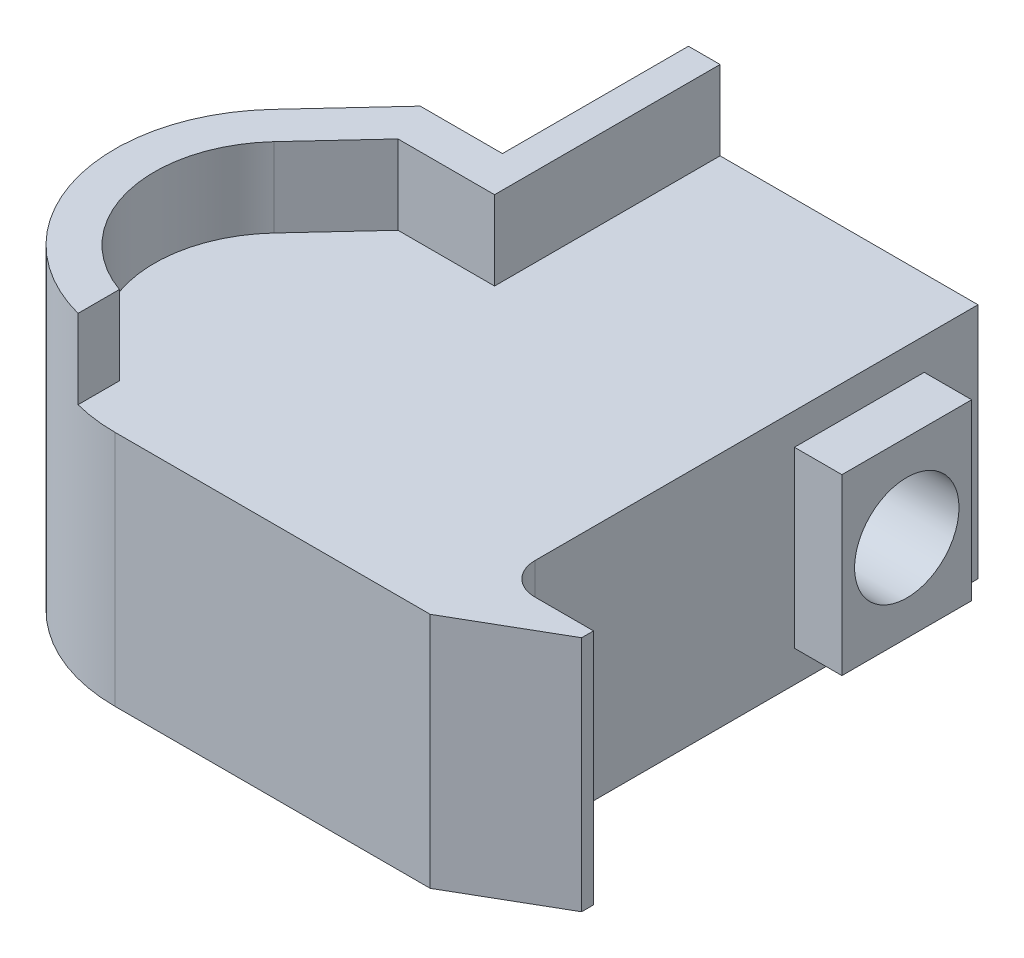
ISO-10303-21;
HEADER;
FILE_DESCRIPTION(('STEP AP214'),'2;1');
FILE_NAME('part.step','',(''),(''),'','','');
FILE_SCHEMA(('AUTOMOTIVE_DESIGN { 1 0 10303 214 1 1 1 1 }'));
ENDSEC;
DATA;
#1=APPLICATION_CONTEXT('core data for automotive mechanical design processes');
#2=APPLICATION_PROTOCOL_DEFINITION('international standard','automotive_design',2000,#1);
#3=PRODUCT_CONTEXT('',#1,'mechanical');
#4=PRODUCT('Part','Part','',(#3));
#5=PRODUCT_RELATED_PRODUCT_CATEGORY('part','',(#4));
#6=PRODUCT_DEFINITION_FORMATION('','',#4);
#7=PRODUCT_DEFINITION_CONTEXT('part definition',#1,'design');
#8=PRODUCT_DEFINITION('design','',#6,#7);
#9=PRODUCT_DEFINITION_SHAPE('','',#8);
#10=(LENGTH_UNIT() NAMED_UNIT(*) SI_UNIT(.MILLI.,.METRE.));
#11=(NAMED_UNIT(*) PLANE_ANGLE_UNIT() SI_UNIT($,.RADIAN.));
#12=(NAMED_UNIT(*) SI_UNIT($,.STERADIAN.) SOLID_ANGLE_UNIT());
#13=UNCERTAINTY_MEASURE_WITH_UNIT(LENGTH_MEASURE(1.E-05),#10,'distance_accuracy_value','');
#14=(GEOMETRIC_REPRESENTATION_CONTEXT(3) GLOBAL_UNCERTAINTY_ASSIGNED_CONTEXT((#13)) GLOBAL_UNIT_ASSIGNED_CONTEXT((#10,
#11,#12)) REPRESENTATION_CONTEXT('',''));
#15=CARTESIAN_POINT('',(0.,0.,0.));
#16=DIRECTION('',(0.,0.,1.));
#17=DIRECTION('',(1.,0.,0.));
#18=AXIS2_PLACEMENT_3D('',#15,#16,#17);
#19=CARTESIAN_POINT('',(-13.5000000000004,0.,0.));
#20=DIRECTION('',(1.,0.,0.));
#21=DIRECTION('',(0.,0.,-1.));
#22=AXIS2_PLACEMENT_3D('',#19,#20,#21);
#23=CYLINDRICAL_SURFACE('',#22,3.3);
#24=CARTESIAN_POINT('',(-13.5000000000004,0.,0.));
#25=DIRECTION('',(1.,0.,0.));
#26=DIRECTION('',(0.,0.,-1.));
#27=AXIS2_PLACEMENT_3D('',#24,#25,#26);
#28=CIRCLE('',#27,3.3);
#29=CARTESIAN_POINT('',(-13.5000000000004,0.,-3.30000000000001));
#30=VERTEX_POINT('',#29);
#31=EDGE_CURVE('E240',#30,#30,#28,.F.);
#32=ORIENTED_EDGE('',*,*,#31,.T.);
#33=EDGE_LOOP('',(#32));
#34=FACE_BOUND('',#33,.T.);
#35=CARTESIAN_POINT('',(3.00000000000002,0.,0.));
#36=DIRECTION('',(1.,0.,0.));
#37=DIRECTION('',(0.,0.,-1.));
#38=AXIS2_PLACEMENT_3D('',#35,#36,#37);
#39=CIRCLE('',#38,3.3);
#40=CARTESIAN_POINT('',(3.00000000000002,0.,-3.30000000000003));
#41=VERTEX_POINT('',#40);
#42=EDGE_CURVE('E22',#41,#41,#39,.F.);
#43=ORIENTED_EDGE('',*,*,#42,.F.);
#44=EDGE_LOOP('',(#43));
#45=FACE_BOUND('',#44,.T.);
#46=ADVANCED_FACE('F18',(#34,#45),#23,.F.);
#47=CARTESIAN_POINT('',(3.00000000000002,5.50000000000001,-4.10000000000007));
#48=DIRECTION('',(1.,0.,0.));
#49=DIRECTION('',(0.,0.,1.));
#50=AXIS2_PLACEMENT_3D('',#47,#48,#49);
#51=PLANE('',#50);
#52=ORIENTED_EDGE('',*,*,#42,.T.);
#53=EDGE_LOOP('',(#52));
#54=FACE_BOUND('',#53,.T.);
#55=DIRECTION('',(0.,0.,-1.));
#56=VECTOR('',#55,1.);
#57=CARTESIAN_POINT('',(3.00000000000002,-5.5,0.));
#58=LINE('',#57,#56);
#59=CARTESIAN_POINT('',(3.00000000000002,-5.5,4.10000000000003));
#60=VERTEX_POINT('',#59);
#61=CARTESIAN_POINT('',(3.00000000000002,-5.5,-4.10000000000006));
#62=VERTEX_POINT('',#61);
#63=EDGE_CURVE('E221',#60,#62,#58,.T.);
#64=ORIENTED_EDGE('',*,*,#63,.T.);
#65=DIRECTION('',(0.,-1.,0.));
#66=VECTOR('',#65,1.);
#67=CARTESIAN_POINT('',(3.00000000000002,0.,-4.10000000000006));
#68=LINE('',#67,#66);
#69=CARTESIAN_POINT('',(3.00000000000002,5.5,-4.10000000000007));
#70=VERTEX_POINT('',#69);
#71=EDGE_CURVE('E130',#70,#62,#68,.T.);
#72=ORIENTED_EDGE('',*,*,#71,.F.);
#73=DIRECTION('',(0.,0.,-1.));
#74=VECTOR('',#73,1.);
#75=CARTESIAN_POINT('',(3.00000000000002,5.5,0.));
#76=LINE('',#75,#74);
#77=CARTESIAN_POINT('',(3.00000000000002,5.5,4.10000000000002));
#78=VERTEX_POINT('',#77);
#79=EDGE_CURVE('E208',#78,#70,#76,.T.);
#80=ORIENTED_EDGE('',*,*,#79,.F.);
#81=DIRECTION('',(0.,1.,0.));
#82=VECTOR('',#81,1.);
#83=CARTESIAN_POINT('',(3.00000000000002,0.,4.10000000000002));
#84=LINE('',#83,#82);
#85=EDGE_CURVE('E218',#60,#78,#84,.T.);
#86=ORIENTED_EDGE('',*,*,#85,.F.);
#87=EDGE_LOOP('',(#64,#72,#80,#86));
#88=FACE_BOUND('',#87,.T.);
#89=ADVANCED_FACE('F294',(#54,#88),#51,.T.);
#90=CARTESIAN_POINT('',(-13.5000000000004,-5.61,5.60999999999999));
#91=DIRECTION('',(1.,0.,0.));
#92=DIRECTION('',(0.,0.,-1.));
#93=AXIS2_PLACEMENT_3D('',#90,#91,#92);
#94=PLANE('',#93);
#95=ORIENTED_EDGE('',*,*,#31,.F.);
#96=EDGE_LOOP('',(#95));
#97=FACE_BOUND('',#96,.T.);
#98=CARTESIAN_POINT('',(-13.5000000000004,0.,0.));
#99=DIRECTION('',(-1.,0.,0.));
#100=DIRECTION('',(0.,0.,1.));
#101=AXIS2_PLACEMENT_3D('',#98,#99,#100);
#102=CIRCLE('',#101,5.5);
#103=CARTESIAN_POINT('',(-13.5000000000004,0.,5.49999999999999));
#104=VERTEX_POINT('',#103);
#105=EDGE_CURVE('E189',#104,#104,#102,.T.);
#106=ORIENTED_EDGE('',*,*,#105,.T.);
#107=EDGE_LOOP('',(#106));
#108=FACE_BOUND('',#107,.T.);
#109=ADVANCED_FACE('F304',(#97,#108),#94,.F.);
#110=CARTESIAN_POINT('',(-16.3,12.5,6.75299672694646));
#111=DIRECTION('',(1.40402747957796E-07,0.,0.99999999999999));
#112=DIRECTION('',(-0.99999999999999,0.,1.40402747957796E-07));
#113=AXIS2_PLACEMENT_3D('',#110,#111,#112);
#114=PLANE('',#113);
#115=DIRECTION('',(-1.,0.,0.));
#116=VECTOR('',#115,1.);
#117=CARTESIAN_POINT('',(-11.4699999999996,7.5,6.75299672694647));
#118=LINE('',#117,#116);
#119=CARTESIAN_POINT('',(-16.3000000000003,7.5,6.75299672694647));
#120=VERTEX_POINT('',#119);
#121=CARTESIAN_POINT('',(-22.4033370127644,7.5,6.75299715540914));
#122=VERTEX_POINT('',#121);
#123=EDGE_CURVE('E185',#120,#122,#118,.T.);
#124=ORIENTED_EDGE('',*,*,#123,.F.);
#125=DIRECTION('',(0.,-1.,0.));
#126=VECTOR('',#125,1.);
#127=CARTESIAN_POINT('',(-16.3,10.,6.75299672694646));
#128=LINE('',#127,#126);
#129=CARTESIAN_POINT('',(-16.3000000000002,12.5,6.75299729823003));
#130=VERTEX_POINT('',#129);
#131=EDGE_CURVE('E183',#130,#120,#128,.T.);
#132=ORIENTED_EDGE('',*,*,#131,.F.);
#133=DIRECTION('',(1.,0.,0.));
#134=VECTOR('',#133,1.);
#135=CARTESIAN_POINT('',(-23.6225,12.5,6.75299758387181));
#136=LINE('',#135,#134);
#137=CARTESIAN_POINT('',(-22.4033374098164,12.5,6.75299758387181));
#138=VERTEX_POINT('',#137);
#139=EDGE_CURVE('E168',#138,#130,#136,.T.);
#140=ORIENTED_EDGE('',*,*,#139,.F.);
#141=DIRECTION('',(0.,1.,0.));
#142=VECTOR('',#141,1.);
#143=CARTESIAN_POINT('',(-22.4033374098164,10.,6.7529975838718));
#144=LINE('',#143,#142);
#145=EDGE_CURVE('E238',#122,#138,#144,.T.);
#146=ORIENTED_EDGE('',*,*,#145,.F.);
#147=EDGE_LOOP('',(#124,#132,#140,#146));
#148=FACE_BOUND('',#147,.T.);
#149=ADVANCED_FACE('F184',(#148),#114,.T.);
#150=CARTESIAN_POINT('',(-22.4033374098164,12.5,6.7529975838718));
#151=DIRECTION('',(0.73348123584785,0.,0.679709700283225));
#152=DIRECTION('',(-0.679709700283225,0.,0.73348123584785));
#153=AXIS2_PLACEMENT_3D('',#150,#151,#152);
#154=PLANE('',#153);
#155=DIRECTION('',(-0.679709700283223,0.,0.733481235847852));
#156=VECTOR('',#155,1.);
#157=CARTESIAN_POINT('',(-22.4033374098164,7.5,6.75299758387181));
#158=LINE('',#157,#156);
#159=CARTESIAN_POINT('',(-26.1678498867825,7.5,10.8153189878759));
#160=VERTEX_POINT('',#159);
#161=EDGE_CURVE('E241',#122,#160,#158,.T.);
#162=ORIENTED_EDGE('',*,*,#161,.F.);
#163=ORIENTED_EDGE('',*,*,#145,.T.);
#164=DIRECTION('',(0.679709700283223,0.,-0.733481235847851));
#165=VECTOR('',#164,1.);
#166=CARTESIAN_POINT('',(-26.1678498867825,12.5,10.8153189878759));
#167=LINE('',#166,#165);
#168=CARTESIAN_POINT('',(-26.1678498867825,12.5,10.8153189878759));
#169=VERTEX_POINT('',#168);
#170=EDGE_CURVE('E178',#169,#138,#167,.T.);
#171=ORIENTED_EDGE('',*,*,#170,.F.);
#172=DIRECTION('',(0.,1.,0.));
#173=VECTOR('',#172,1.);
#174=CARTESIAN_POINT('',(-26.1678498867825,10.,10.8153189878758));
#175=LINE('',#174,#173);
#176=EDGE_CURVE('E232',#160,#169,#175,.T.);
#177=ORIENTED_EDGE('',*,*,#176,.F.);
#178=EDGE_LOOP('',(#162,#163,#171,#177));
#179=FACE_BOUND('',#178,.T.);
#180=ADVANCED_FACE('F509',(#179),#154,.T.);
#181=CARTESIAN_POINT('',(-20.2999999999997,7.5,16.2529965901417));
#182=DIRECTION('',(0.,1.,0.));
#183=DIRECTION('',(0.,0.,1.));
#184=AXIS2_PLACEMENT_3D('',#181,#182,#183);
#185=CYLINDRICAL_SURFACE('',#184,8.);
#186=CARTESIAN_POINT('',(-20.2999999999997,12.5,16.2529965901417));
#187=DIRECTION('',(0.,1.,0.));
#188=DIRECTION('',(0.,0.,1.));
#189=AXIS2_PLACEMENT_3D('',#186,#187,#188);
#190=CIRCLE('',#189,8.);
#191=CARTESIAN_POINT('',(-22.9666659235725,12.5,23.7954691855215));
#192=VERTEX_POINT('',#191);
#193=EDGE_CURVE('E243',#192,#169,#190,.F.);
#194=ORIENTED_EDGE('',*,*,#193,.F.);
#195=DIRECTION('',(0.,1.,0.));
#196=VECTOR('',#195,1.);
#197=CARTESIAN_POINT('',(-22.9666659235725,10.,23.7954691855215));
#198=LINE('',#197,#196);
#199=CARTESIAN_POINT('',(-22.9666659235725,7.50000000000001,23.7954691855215));
#200=VERTEX_POINT('',#199);
#201=EDGE_CURVE('E117',#200,#192,#198,.T.);
#202=ORIENTED_EDGE('',*,*,#201,.F.);
#203=CARTESIAN_POINT('',(-20.2999999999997,7.5,16.2529965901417));
#204=DIRECTION('',(0.,1.,0.));
#205=DIRECTION('',(0.,0.,1.));
#206=AXIS2_PLACEMENT_3D('',#203,#204,#205);
#207=CIRCLE('',#206,8.);
#208=EDGE_CURVE('E280',#160,#200,#207,.T.);
#209=ORIENTED_EDGE('',*,*,#208,.F.);
#210=ORIENTED_EDGE('',*,*,#176,.T.);
#211=EDGE_LOOP('',(#194,#202,#209,#210));
#212=FACE_BOUND('',#211,.T.);
#213=ADVANCED_FACE('F504',(#212),#185,.F.);
#214=CARTESIAN_POINT('',(5.70000000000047,7.5,22.4999999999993));
#215=DIRECTION('',(1.,0.,0.));
#216=DIRECTION('',(0.,0.,1.));
#217=AXIS2_PLACEMENT_3D('',#214,#215,#216);
#218=PLANE('',#217);
#219=DIRECTION('',(0.,1.,0.));
#220=VECTOR('',#219,1.);
#221=CARTESIAN_POINT('',(5.70000000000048,0.,23.2499999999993));
#222=LINE('',#221,#220);
#223=CARTESIAN_POINT('',(5.70000000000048,-7.5,23.2499999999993));
#224=VERTEX_POINT('',#223);
#225=CARTESIAN_POINT('',(5.70000000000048,7.5,23.2499999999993));
#226=VERTEX_POINT('',#225);
#227=EDGE_CURVE('E283',#224,#226,#222,.T.);
#228=ORIENTED_EDGE('',*,*,#227,.F.);
#229=DIRECTION('',(0.,0.,-1.));
#230=VECTOR('',#229,1.);
#231=CARTESIAN_POINT('',(5.70000000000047,-7.5,22.8749999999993));
#232=LINE('',#231,#230);
#233=CARTESIAN_POINT('',(5.70000000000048,-7.5,22.4999999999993));
#234=VERTEX_POINT('',#233);
#235=EDGE_CURVE('E224',#224,#234,#232,.T.);
#236=ORIENTED_EDGE('',*,*,#235,.T.);
#237=DIRECTION('',(0.,-1.,0.));
#238=VECTOR('',#237,1.);
#239=CARTESIAN_POINT('',(5.70000000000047,0.,22.4999999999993));
#240=LINE('',#239,#238);
#241=CARTESIAN_POINT('',(5.70000000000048,7.5,22.4999999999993));
#242=VERTEX_POINT('',#241);
#243=EDGE_CURVE('E228',#242,#234,#240,.T.);
#244=ORIENTED_EDGE('',*,*,#243,.F.);
#245=DIRECTION('',(0.,0.,-1.));
#246=VECTOR('',#245,1.);
#247=CARTESIAN_POINT('',(5.70000000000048,7.5,9.62649863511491));
#248=LINE('',#247,#246);
#249=EDGE_CURVE('E233',#226,#242,#248,.T.);
#250=ORIENTED_EDGE('',*,*,#249,.F.);
#251=EDGE_LOOP('',(#228,#236,#244,#250));
#252=FACE_BOUND('',#251,.T.);
#253=ADVANCED_FACE('F457',(#252),#218,.T.);
#254=CARTESIAN_POINT('',(0.,-5.5,-4.10000000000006));
#255=DIRECTION('',(0.,1.,0.));
#256=DIRECTION('',(0.,0.,1.));
#257=AXIS2_PLACEMENT_3D('',#254,#255,#256);
#258=PLANE('',#257);
#259=DIRECTION('',(1.,0.,0.));
#260=VECTOR('',#259,1.);
#261=CARTESIAN_POINT('',(1.50000000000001,-5.5,4.10000000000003));
#262=LINE('',#261,#260);
#263=CARTESIAN_POINT('',(0.,-5.5,4.10000000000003));
#264=VERTEX_POINT('',#263);
#265=EDGE_CURVE('E214',#264,#60,#262,.T.);
#266=ORIENTED_EDGE('',*,*,#265,.F.);
#267=DIRECTION('',(0.,0.,1.));
#268=VECTOR('',#267,1.);
#269=CARTESIAN_POINT('',(0.,-5.5,6.49999999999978));
#270=LINE('',#269,#268);
#271=CARTESIAN_POINT('',(0.,-5.5,-4.10000000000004));
#272=VERTEX_POINT('',#271);
#273=EDGE_CURVE('E367',#272,#264,#270,.T.);
#274=ORIENTED_EDGE('',*,*,#273,.F.);
#275=DIRECTION('',(-1.,0.,0.));
#276=VECTOR('',#275,1.);
#277=CARTESIAN_POINT('',(1.49999999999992,-5.5,-4.10000000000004));
#278=LINE('',#277,#276);
#279=EDGE_CURVE('E190',#62,#272,#278,.T.);
#280=ORIENTED_EDGE('',*,*,#279,.F.);
#281=ORIENTED_EDGE('',*,*,#63,.F.);
#282=EDGE_LOOP('',(#266,#274,#280,#281));
#283=FACE_BOUND('',#282,.T.);
#284=ADVANCED_FACE('F448',(#283),#258,.F.);
#285=CARTESIAN_POINT('',(3.00000000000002,5.5,4.10000000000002));
#286=DIRECTION('',(0.,0.,1.));
#287=DIRECTION('',(-1.,0.,0.));
#288=AXIS2_PLACEMENT_3D('',#285,#286,#287);
#289=PLANE('',#288);
#290=DIRECTION('',(0.,1.,0.));
#291=VECTOR('',#290,1.);
#292=CARTESIAN_POINT('',(0.,0.,4.10000000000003));
#293=LINE('',#292,#291);
#294=CARTESIAN_POINT('',(0.,5.5,4.10000000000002));
#295=VERTEX_POINT('',#294);
#296=EDGE_CURVE('E363',#264,#295,#293,.T.);
#297=ORIENTED_EDGE('',*,*,#296,.F.);
#298=ORIENTED_EDGE('',*,*,#265,.T.);
#299=ORIENTED_EDGE('',*,*,#85,.T.);
#300=DIRECTION('',(1.,0.,0.));
#301=VECTOR('',#300,1.);
#302=CARTESIAN_POINT('',(1.49999999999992,5.5,4.10000000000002));
#303=LINE('',#302,#301);
#304=EDGE_CURVE('E211',#295,#78,#303,.T.);
#305=ORIENTED_EDGE('',*,*,#304,.F.);
#306=EDGE_LOOP('',(#297,#298,#299,#305));
#307=FACE_BOUND('',#306,.T.);
#308=ADVANCED_FACE('F451',(#307),#289,.T.);
#309=CARTESIAN_POINT('',(-1.716405E-13,5.5,-4.10000000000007));
#310=DIRECTION('',(0.,1.,0.));
#311=DIRECTION('',(0.,0.,1.));
#312=AXIS2_PLACEMENT_3D('',#309,#310,#311);
#313=PLANE('',#312);
#314=ORIENTED_EDGE('',*,*,#304,.T.);
#315=ORIENTED_EDGE('',*,*,#79,.T.);
#316=DIRECTION('',(1.,0.,0.));
#317=VECTOR('',#316,1.);
#318=CARTESIAN_POINT('',(1.49999999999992,5.5,-4.10000000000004));
#319=LINE('',#318,#317);
#320=CARTESIAN_POINT('',(-1.72957286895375E-13,5.5,-4.10000000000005));
#321=VERTEX_POINT('',#320);
#322=EDGE_CURVE('E206',#321,#70,#319,.T.);
#323=ORIENTED_EDGE('',*,*,#322,.F.);
#324=DIRECTION('',(0.,0.,-1.));
#325=VECTOR('',#324,1.);
#326=CARTESIAN_POINT('',(0.,5.5,6.49999999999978));
#327=LINE('',#326,#325);
#328=EDGE_CURVE('E359',#295,#321,#327,.T.);
#329=ORIENTED_EDGE('',*,*,#328,.F.);
#330=EDGE_LOOP('',(#314,#315,#323,#329));
#331=FACE_BOUND('',#330,.T.);
#332=ADVANCED_FACE('F442',(#331),#313,.T.);
#333=CARTESIAN_POINT('',(-1.705303E-13,5.5,-4.10000000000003));
#334=DIRECTION('',(0.,0.,-1.));
#335=DIRECTION('',(1.,0.,0.));
#336=AXIS2_PLACEMENT_3D('',#333,#334,#335);
#337=PLANE('',#336);
#338=ORIENTED_EDGE('',*,*,#71,.T.);
#339=ORIENTED_EDGE('',*,*,#279,.T.);
#340=DIRECTION('',(0.,-1.,0.));
#341=VECTOR('',#340,1.);
#342=CARTESIAN_POINT('',(-1.7840126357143E-13,0.,-4.10000000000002));
#343=LINE('',#342,#341);
#344=EDGE_CURVE('E354',#321,#272,#343,.T.);
#345=ORIENTED_EDGE('',*,*,#344,.F.);
#346=ORIENTED_EDGE('',*,*,#322,.T.);
#347=EDGE_LOOP('',(#338,#339,#345,#346));
#348=FACE_BOUND('',#347,.T.);
#349=ADVANCED_FACE('F444',(#348),#337,.T.);
#350=CARTESIAN_POINT('',(-16.3000000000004,12.5,-7.49999999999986));
#351=DIRECTION('',(1.,0.,0.));
#352=DIRECTION('',(0.,0.,1.));
#353=AXIS2_PLACEMENT_3D('',#350,#351,#352);
#354=PLANE('',#353);
#355=DIRECTION('',(0.,0.,-1.));
#356=VECTOR('',#355,1.);
#357=CARTESIAN_POINT('',(-16.3000000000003,12.5,9.4543643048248));
#358=LINE('',#357,#356);
#359=CARTESIAN_POINT('',(-16.3000000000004,12.5,-7.49999999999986));
#360=VERTEX_POINT('',#359);
#361=EDGE_CURVE('E174',#130,#360,#358,.T.);
#362=ORIENTED_EDGE('',*,*,#361,.F.);
#363=ORIENTED_EDGE('',*,*,#131,.T.);
#364=DIRECTION('',(0.,0.,1.));
#365=VECTOR('',#364,1.);
#366=CARTESIAN_POINT('',(-16.3000000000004,7.5,9.62649863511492));
#367=LINE('',#366,#365);
#368=CARTESIAN_POINT('',(-16.3000000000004,7.5,-7.49999999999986));
#369=VERTEX_POINT('',#368);
#370=EDGE_CURVE('E235',#369,#120,#367,.T.);
#371=ORIENTED_EDGE('',*,*,#370,.F.);
#372=DIRECTION('',(0.,-1.,0.));
#373=VECTOR('',#372,1.);
#374=CARTESIAN_POINT('',(-16.3000000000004,2.5,-7.49999999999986));
#375=LINE('',#374,#373);
#376=EDGE_CURVE('E194',#360,#369,#375,.T.);
#377=ORIENTED_EDGE('',*,*,#376,.F.);
#378=EDGE_LOOP('',(#362,#363,#371,#377));
#379=FACE_BOUND('',#378,.T.);
#380=ADVANCED_FACE('F193',(#379),#354,.T.);
#381=CARTESIAN_POINT('',(-23.4950161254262,12.5,4.25299773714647));
#382=DIRECTION('',(-1.40402747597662E-07,0.,-0.99999999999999));
#383=DIRECTION('',(0.99999999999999,0.,-1.40402747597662E-07));
#384=AXIS2_PLACEMENT_3D('',#381,#382,#383);
#385=PLANE('',#384);
#386=DIRECTION('',(-1.,0.,0.));
#387=VECTOR('',#386,1.);
#388=CARTESIAN_POINT('',(-23.6225,12.5,4.25299700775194));
#389=LINE('',#388,#387);
#390=CARTESIAN_POINT('',(-18.3000000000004,12.5,4.25299700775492));
#391=VERTEX_POINT('',#390);
#392=CARTESIAN_POINT('',(-23.4950161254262,12.5,4.25299749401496));
#393=VERTEX_POINT('',#392);
#394=EDGE_CURVE('E195',#391,#393,#389,.T.);
#395=ORIENTED_EDGE('',*,*,#394,.F.);
#396=DIRECTION('',(0.,1.,0.));
#397=VECTOR('',#396,1.);
#398=CARTESIAN_POINT('',(-18.3000000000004,2.5,4.25299700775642));
#399=LINE('',#398,#397);
#400=CARTESIAN_POINT('',(-18.3000000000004,3.48740827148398,4.25299700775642));
#401=VERTEX_POINT('',#400);
#402=EDGE_CURVE('E275',#401,#391,#399,.T.);
#403=ORIENTED_EDGE('',*,*,#402,.F.);
#404=DIRECTION('',(-1.,0.,0.));
#405=VECTOR('',#404,1.);
#406=CARTESIAN_POINT('',(-19.1310533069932,3.48740827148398,4.25299700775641));
#407=LINE('',#406,#405);
#408=CARTESIAN_POINT('',(-23.4950157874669,3.48740782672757,4.25299737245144));
#409=VERTEX_POINT('',#408);
#410=EDGE_CURVE('E244',#401,#409,#407,.T.);
#411=ORIENTED_EDGE('',*,*,#410,.T.);
#412=DIRECTION('',(0.,-1.,0.));
#413=VECTOR('',#412,1.);
#414=CARTESIAN_POINT('',(-23.4950161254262,2.5,4.25299773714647));
#415=LINE('',#414,#413);
#416=EDGE_CURVE('E271',#393,#409,#415,.T.);
#417=ORIENTED_EDGE('',*,*,#416,.F.);
#418=EDGE_LOOP('',(#395,#403,#411,#417));
#419=FACE_BOUND('',#418,.T.);
#420=ADVANCED_FACE('F415',(#419),#385,.T.);
#421=CARTESIAN_POINT('',(-13.5000000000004,0.,0.));
#422=DIRECTION('',(-1.,0.,0.));
#423=DIRECTION('',(0.,0.,1.));
#424=AXIS2_PLACEMENT_3D('',#421,#422,#423);
#425=CYLINDRICAL_SURFACE('',#424,5.5);
#426=CARTESIAN_POINT('',(-19.5538058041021,0.,0.));
#427=DIRECTION('',(-0.73348123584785,0.,-0.679709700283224));
#428=DIRECTION('',(-0.679709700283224,0.,0.73348123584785));
#429=AXIS2_PLACEMENT_3D('',#426,#427,#428);
#430=ELLIPSE('',#429,7.49848766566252,5.5);
#431=CARTESIAN_POINT('',(-23.4950161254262,-3.48740738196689,4.25299773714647));
#432=VERTEX_POINT('',#431);
#433=EDGE_CURVE('E269',#409,#432,#430,.F.);
#434=ORIENTED_EDGE('',*,*,#433,.F.);
#435=ORIENTED_EDGE('',*,*,#410,.F.);
#436=CARTESIAN_POINT('',(-18.3000000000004,0.,0.));
#437=DIRECTION('',(-1.,0.,0.));
#438=DIRECTION('',(0.,0.,1.));
#439=AXIS2_PLACEMENT_3D('',#436,#437,#438);
#440=CIRCLE('',#439,5.5);
#441=CARTESIAN_POINT('',(-18.3000000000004,-3.48740782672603,4.25299700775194));
#442=VERTEX_POINT('',#441);
#443=EDGE_CURVE('E272',#442,#401,#440,.F.);
#444=ORIENTED_EDGE('',*,*,#443,.F.);
#445=DIRECTION('',(0.99999999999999,0.,-1.40402747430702E-07));
#446=VECTOR('',#445,1.);
#447=CARTESIAN_POINT('',(-20.8975080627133,-3.48740738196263,4.25299737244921));
#448=LINE('',#447,#446);
#449=EDGE_CURVE('E338',#432,#442,#448,.T.);
#450=ORIENTED_EDGE('',*,*,#449,.F.);
#451=EDGE_LOOP('',(#434,#435,#444,#450));
#452=FACE_BOUND('',#451,.T.);
#453=ORIENTED_EDGE('',*,*,#105,.F.);
#454=EDGE_LOOP('',(#453));
#455=FACE_BOUND('',#454,.T.);
#456=ADVANCED_FACE('F418',(#452,#455),#425,.F.);
#457=CARTESIAN_POINT('',(-22.9666659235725,12.5,23.7954691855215));
#458=DIRECTION('',(1.,0.,0.));
#459=DIRECTION('',(0.,0.,1.));
#460=AXIS2_PLACEMENT_3D('',#457,#458,#459);
#461=PLANE('',#460);
#462=DIRECTION('',(0.,0.,1.));
#463=VECTOR('',#462,1.);
#464=CARTESIAN_POINT('',(-22.9666659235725,7.5,9.62649863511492));
#465=LINE('',#464,#463);
#466=CARTESIAN_POINT('',(-22.9666659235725,7.50000000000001,26.4087286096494));
#467=VERTEX_POINT('',#466);
#468=EDGE_CURVE('E236',#200,#467,#465,.T.);
#469=ORIENTED_EDGE('',*,*,#468,.F.);
#470=ORIENTED_EDGE('',*,*,#201,.T.);
#471=DIRECTION('',(0.,0.,-1.));
#472=VECTOR('',#471,1.);
#473=CARTESIAN_POINT('',(-22.9666659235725,12.5,9.4543643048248));
#474=LINE('',#473,#472);
#475=CARTESIAN_POINT('',(-22.9666659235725,12.5,26.4087286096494));
#476=VERTEX_POINT('',#475);
#477=EDGE_CURVE('E197',#476,#192,#474,.T.);
#478=ORIENTED_EDGE('',*,*,#477,.F.);
#479=DIRECTION('',(0.,1.,0.));
#480=VECTOR('',#479,1.);
#481=CARTESIAN_POINT('',(-22.9666659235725,2.5,26.4087286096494));
#482=LINE('',#481,#480);
#483=EDGE_CURVE('E264',#467,#476,#482,.T.);
#484=ORIENTED_EDGE('',*,*,#483,.F.);
#485=EDGE_LOOP('',(#469,#470,#478,#484));
#486=FACE_BOUND('',#485,.T.);
#487=ADVANCED_FACE('F469',(#486),#461,.T.);
#488=CARTESIAN_POINT('',(-30.9449999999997,12.5,-7.49999999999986));
#489=DIRECTION('',(0.,1.,0.));
#490=DIRECTION('',(0.,0.,1.));
#491=AXIS2_PLACEMENT_3D('',#488,#489,#490);
#492=PLANE('',#491);
#493=CARTESIAN_POINT('',(-20.2999999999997,12.5,16.2529965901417));
#494=DIRECTION('',(0.,-1.,0.));
#495=DIRECTION('',(1.,0.,0.));
#496=AXIS2_PLACEMENT_3D('',#493,#494,#495);
#497=CIRCLE('',#496,10.5);
#498=CARTESIAN_POINT('',(-28.0015529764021,12.5,9.11604473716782));
#499=VERTEX_POINT('',#498);
#500=EDGE_CURVE('E261',#476,#499,#497,.T.);
#501=ORIENTED_EDGE('',*,*,#500,.F.);
#502=ORIENTED_EDGE('',*,*,#477,.T.);
#503=ORIENTED_EDGE('',*,*,#193,.T.);
#504=ORIENTED_EDGE('',*,*,#170,.T.);
#505=ORIENTED_EDGE('',*,*,#139,.T.);
#506=ORIENTED_EDGE('',*,*,#361,.T.);
#507=DIRECTION('',(1.,0.,0.));
#508=VECTOR('',#507,1.);
#509=CARTESIAN_POINT('',(-9.15000000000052,12.5,-7.49999999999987));
#510=LINE('',#509,#508);
#511=CARTESIAN_POINT('',(-18.3000000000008,12.5,-7.49999999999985));
#512=VERTEX_POINT('',#511);
#513=EDGE_CURVE('E358',#512,#360,#510,.T.);
#514=ORIENTED_EDGE('',*,*,#513,.F.);
#515=DIRECTION('',(0.,0.,-1.));
#516=VECTOR('',#515,1.);
#517=CARTESIAN_POINT('',(-18.3000000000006,12.5,-1.62350149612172));
#518=LINE('',#517,#516);
#519=EDGE_CURVE('E343',#391,#512,#518,.T.);
#520=ORIENTED_EDGE('',*,*,#519,.F.);
#521=ORIENTED_EDGE('',*,*,#394,.T.);
#522=DIRECTION('',(0.679709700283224,0.,-0.73348123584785));
#523=VECTOR('',#522,1.);
#524=CARTESIAN_POINT('',(-25.7482845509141,12.5,6.68452123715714));
#525=LINE('',#524,#523);
#526=EDGE_CURVE('E332',#499,#393,#525,.T.);
#527=ORIENTED_EDGE('',*,*,#526,.F.);
#528=EDGE_LOOP('',(#501,#502,#503,#504,#505,#506,#514,#520,#521,#527));
#529=FACE_BOUND('',#528,.T.);
#530=ADVANCED_FACE('F171',(#529),#492,.T.);
#531=CARTESIAN_POINT('',(-28.6399999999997,7.49999999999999,-7.49999999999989));
#532=DIRECTION('',(0.,1.,0.));
#533=DIRECTION('',(0.,0.,1.));
#534=AXIS2_PLACEMENT_3D('',#531,#532,#533);
#535=PLANE('',#534);
#536=ORIENTED_EDGE('',*,*,#161,.T.);
#537=ORIENTED_EDGE('',*,*,#208,.T.);
#538=ORIENTED_EDGE('',*,*,#468,.T.);
#539=CARTESIAN_POINT('',(-20.2999999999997,7.50000000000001,16.2529965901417));
#540=DIRECTION('',(0.,-1.,0.));
#541=DIRECTION('',(1.,0.,0.));
#542=AXIS2_PLACEMENT_3D('',#539,#540,#541);
#543=CIRCLE('',#542,10.5);
#544=CARTESIAN_POINT('',(-20.3000007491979,7.5,26.7529957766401));
#545=VERTEX_POINT('',#544);
#546=EDGE_CURVE('E265',#545,#467,#543,.T.);
#547=ORIENTED_EDGE('',*,*,#546,.F.);
#548=DIRECTION('',(-0.999999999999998,0.,-7.13522140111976E-08));
#549=VECTOR('',#548,1.);
#550=CARTESIAN_POINT('',(-10.3336849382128,7.5,26.7529964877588));
#551=LINE('',#550,#549);
#552=CARTESIAN_POINT('',(-0.36736912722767,7.5,26.7529971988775));
#553=VERTEX_POINT('',#552);
#554=EDGE_CURVE('E379',#553,#545,#551,.T.);
#555=ORIENTED_EDGE('',*,*,#554,.F.);
#556=DIRECTION('',(-0.866025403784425,0.,0.500000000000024));
#557=VECTOR('',#556,1.);
#558=CARTESIAN_POINT('',(2.66631543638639,7.5,25.0014985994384));
#559=LINE('',#558,#557);
#560=EDGE_CURVE('E229',#226,#553,#559,.T.);
#561=ORIENTED_EDGE('',*,*,#560,.F.);
#562=ORIENTED_EDGE('',*,*,#249,.T.);
#563=DIRECTION('',(1.,0.,0.));
#564=VECTOR('',#563,1.);
#565=CARTESIAN_POINT('',(3.85000000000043,7.5,22.4999999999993));
#566=LINE('',#565,#564);
#567=CARTESIAN_POINT('',(2.0000000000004,7.50000000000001,22.4999999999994));
#568=VERTEX_POINT('',#567);
#569=EDGE_CURVE('E225',#568,#242,#566,.T.);
#570=ORIENTED_EDGE('',*,*,#569,.F.);
#571=CARTESIAN_POINT('',(2.00000000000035,7.50000000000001,20.4999999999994));
#572=DIRECTION('',(0.,1.,0.));
#573=DIRECTION('',(-1.,0.,0.));
#574=AXIS2_PLACEMENT_3D('',#571,#572,#573);
#575=CIRCLE('',#574,1.99999999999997);
#576=CARTESIAN_POINT('',(3.86043327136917E-13,7.50000000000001,20.4999999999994));
#577=VERTEX_POINT('',#576);
#578=EDGE_CURVE('E277',#577,#568,#575,.T.);
#579=ORIENTED_EDGE('',*,*,#578,.F.);
#580=DIRECTION('',(0.,0.,1.));
#581=VECTOR('',#580,1.);
#582=CARTESIAN_POINT('',(0.,7.50000000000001,6.49999999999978));
#583=LINE('',#582,#581);
#584=CARTESIAN_POINT('',(-2.63321405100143E-13,7.5,-7.49999999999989));
#585=VERTEX_POINT('',#584);
#586=EDGE_CURVE('E373',#585,#577,#583,.T.);
#587=ORIENTED_EDGE('',*,*,#586,.F.);
#588=DIRECTION('',(1.,0.,0.));
#589=VECTOR('',#588,1.);
#590=CARTESIAN_POINT('',(-9.15000000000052,7.5,-7.49999999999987));
#591=LINE('',#590,#589);
#592=EDGE_CURVE('E353',#369,#585,#591,.T.);
#593=ORIENTED_EDGE('',*,*,#592,.F.);
#594=ORIENTED_EDGE('',*,*,#370,.T.);
#595=ORIENTED_EDGE('',*,*,#123,.T.);
#596=EDGE_LOOP('',(#536,#537,#538,#547,#555,#561,#562,#570,#579,#587,#593,#594,#595));
#597=FACE_BOUND('',#596,.T.);
#598=ADVANCED_FACE('F396',(#597),#535,.T.);
#599=CARTESIAN_POINT('',(5.70000000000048,7.5,23.2499999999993));
#600=DIRECTION('',(0.500000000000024,0.,0.866025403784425));
#601=DIRECTION('',(-0.866025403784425,0.,0.500000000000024));
#602=AXIS2_PLACEMENT_3D('',#599,#600,#601);
#603=PLANE('',#602);
#604=ORIENTED_EDGE('',*,*,#560,.T.);
#605=DIRECTION('',(0.,1.,0.));
#606=VECTOR('',#605,1.);
#607=CARTESIAN_POINT('',(-0.36736912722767,0.,26.7529971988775));
#608=LINE('',#607,#606);
#609=CARTESIAN_POINT('',(-0.367367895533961,-7.5,26.7529964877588));
#610=VERTEX_POINT('',#609);
#611=EDGE_CURVE('E260',#610,#553,#608,.T.);
#612=ORIENTED_EDGE('',*,*,#611,.F.);
#613=DIRECTION('',(-0.866025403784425,0.,0.500000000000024));
#614=VECTOR('',#613,1.);
#615=CARTESIAN_POINT('',(5.70000000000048,-7.5,23.2499999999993));
#616=LINE('',#615,#614);
#617=EDGE_CURVE('E257',#610,#224,#616,.F.);
#618=ORIENTED_EDGE('',*,*,#617,.T.);
#619=ORIENTED_EDGE('',*,*,#227,.T.);
#620=EDGE_LOOP('',(#604,#612,#618,#619));
#621=FACE_BOUND('',#620,.T.);
#622=ADVANCED_FACE('F476',(#621),#603,.T.);
#623=CARTESIAN_POINT('',(2.00000000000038,7.5,22.4999999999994));
#624=DIRECTION('',(0.,0.,-1.));
#625=DIRECTION('',(1.,0.,0.));
#626=AXIS2_PLACEMENT_3D('',#623,#624,#625);
#627=PLANE('',#626);
#628=ORIENTED_EDGE('',*,*,#569,.T.);
#629=ORIENTED_EDGE('',*,*,#243,.T.);
#630=DIRECTION('',(-1.,0.,0.));
#631=VECTOR('',#630,1.);
#632=CARTESIAN_POINT('',(-12.7324999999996,-7.5,22.4999999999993));
#633=LINE('',#632,#631);
#634=CARTESIAN_POINT('',(2.00000000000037,-7.5,22.4999999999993));
#635=VERTEX_POINT('',#634);
#636=EDGE_CURVE('E256',#234,#635,#633,.T.);
#637=ORIENTED_EDGE('',*,*,#636,.T.);
#638=DIRECTION('',(0.,-1.,0.));
#639=VECTOR('',#638,1.);
#640=CARTESIAN_POINT('',(2.00000000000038,0.,22.4999999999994));
#641=LINE('',#640,#639);
#642=EDGE_CURVE('E279',#568,#635,#641,.T.);
#643=ORIENTED_EDGE('',*,*,#642,.F.);
#644=EDGE_LOOP('',(#628,#629,#637,#643));
#645=FACE_BOUND('',#644,.T.);
#646=ADVANCED_FACE('F479',(#645),#627,.T.);
#647=CARTESIAN_POINT('',(2.00000000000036,-7.5,20.4999999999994));
#648=DIRECTION('',(0.,1.,0.));
#649=DIRECTION('',(-1.,0.,0.));
#650=AXIS2_PLACEMENT_3D('',#647,#648,#649);
#651=CYLINDRICAL_SURFACE('',#650,1.99999999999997);
#652=ORIENTED_EDGE('',*,*,#578,.T.);
#653=ORIENTED_EDGE('',*,*,#642,.T.);
#654=CARTESIAN_POINT('',(2.00000000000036,-7.5,20.4999999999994));
#655=DIRECTION('',(0.,1.,0.));
#656=DIRECTION('',(-1.,0.,0.));
#657=AXIS2_PLACEMENT_3D('',#654,#655,#656);
#658=CIRCLE('',#657,1.99999999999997);
#659=CARTESIAN_POINT('',(3.86843335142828E-13,-7.5,20.4999999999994));
#660=VERTEX_POINT('',#659);
#661=EDGE_CURVE('E252',#635,#660,#658,.F.);
#662=ORIENTED_EDGE('',*,*,#661,.T.);
#663=DIRECTION('',(0.,-1.,0.));
#664=VECTOR('',#663,1.);
#665=CARTESIAN_POINT('',(3.85677E-13,0.,20.4999999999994));
#666=LINE('',#665,#664);
#667=EDGE_CURVE('E371',#577,#660,#666,.T.);
#668=ORIENTED_EDGE('',*,*,#667,.F.);
#669=EDGE_LOOP('',(#652,#653,#662,#668));
#670=FACE_BOUND('',#669,.T.);
#671=ADVANCED_FACE('F483',(#670),#651,.F.);
#672=CARTESIAN_POINT('',(-2.563633E-13,7.50000000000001,-7.49999999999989));
#673=DIRECTION('',(1.,0.,0.));
#674=DIRECTION('',(0.,0.,1.));
#675=AXIS2_PLACEMENT_3D('',#672,#673,#674);
#676=PLANE('',#675);
#677=ORIENTED_EDGE('',*,*,#328,.T.);
#678=ORIENTED_EDGE('',*,*,#344,.T.);
#679=ORIENTED_EDGE('',*,*,#273,.T.);
#680=ORIENTED_EDGE('',*,*,#296,.T.);
#681=EDGE_LOOP('',(#677,#678,#679,#680));
#682=FACE_BOUND('',#681,.T.);
#683=ORIENTED_EDGE('',*,*,#667,.T.);
#684=DIRECTION('',(0.,0.,-1.));
#685=VECTOR('',#684,1.);
#686=CARTESIAN_POINT('',(3.86843335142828E-13,-7.5,9.62649859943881));
#687=LINE('',#686,#685);
#688=CARTESIAN_POINT('',(1.67921241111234E-13,-7.5,-7.49999999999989));
#689=VERTEX_POINT('',#688);
#690=EDGE_CURVE('E255',#660,#689,#687,.T.);
#691=ORIENTED_EDGE('',*,*,#690,.T.);
#692=DIRECTION('',(0.,-1.,0.));
#693=VECTOR('',#692,1.);
#694=CARTESIAN_POINT('',(-2.664535E-13,2.5,-7.49999999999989));
#695=LINE('',#694,#693);
#696=EDGE_CURVE('E276',#585,#689,#695,.T.);
#697=ORIENTED_EDGE('',*,*,#696,.F.);
#698=ORIENTED_EDGE('',*,*,#586,.T.);
#699=EDGE_LOOP('',(#683,#691,#697,#698));
#700=FACE_BOUND('',#699,.T.);
#701=ADVANCED_FACE('F435',(#682,#700),#676,.T.);
#702=CARTESIAN_POINT('',(-18.3000000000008,12.5,-7.49999999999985));
#703=DIRECTION('',(0.,0.,-1.));
#704=DIRECTION('',(1.,0.,0.));
#705=AXIS2_PLACEMENT_3D('',#702,#703,#704);
#706=PLANE('',#705);
#707=ORIENTED_EDGE('',*,*,#696,.T.);
#708=DIRECTION('',(-1.,0.,0.));
#709=VECTOR('',#708,1.);
#710=CARTESIAN_POINT('',(-12.7324999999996,-7.50000000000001,-7.49999999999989));
#711=LINE('',#710,#709);
#712=CARTESIAN_POINT('',(-18.3000000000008,-7.5,-7.49999999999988));
#713=VERTEX_POINT('',#712);
#714=EDGE_CURVE('E341',#689,#713,#711,.T.);
#715=ORIENTED_EDGE('',*,*,#714,.T.);
#716=DIRECTION('',(0.,-1.,0.));
#717=VECTOR('',#716,1.);
#718=CARTESIAN_POINT('',(-18.3000000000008,2.5,-7.49999999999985));
#719=LINE('',#718,#717);
#720=EDGE_CURVE('E344',#512,#713,#719,.T.);
#721=ORIENTED_EDGE('',*,*,#720,.F.);
#722=ORIENTED_EDGE('',*,*,#513,.T.);
#723=ORIENTED_EDGE('',*,*,#376,.T.);
#724=ORIENTED_EDGE('',*,*,#592,.T.);
#725=EDGE_LOOP('',(#707,#715,#721,#722,#723,#724));
#726=FACE_BOUND('',#725,.T.);
#727=ADVANCED_FACE('F401',(#726),#706,.T.);
#728=CARTESIAN_POINT('',(-18.3000000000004,12.5,4.25299700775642));
#729=DIRECTION('',(-1.,0.,0.));
#730=DIRECTION('',(0.,0.,-1.));
#731=AXIS2_PLACEMENT_3D('',#728,#729,#730);
#732=PLANE('',#731);
#733=ORIENTED_EDGE('',*,*,#519,.T.);
#734=ORIENTED_EDGE('',*,*,#720,.T.);
#735=DIRECTION('',(0.,0.,1.));
#736=VECTOR('',#735,1.);
#737=CARTESIAN_POINT('',(-18.3000000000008,-7.5,9.62649859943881));
#738=LINE('',#737,#736);
#739=CARTESIAN_POINT('',(-18.3000000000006,-7.5,4.25299700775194));
#740=VERTEX_POINT('',#739);
#741=EDGE_CURVE('E334',#713,#740,#738,.T.);
#742=ORIENTED_EDGE('',*,*,#741,.T.);
#743=DIRECTION('',(0.,-1.,0.));
#744=VECTOR('',#743,1.);
#745=CARTESIAN_POINT('',(-18.3000000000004,-5.49370369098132,4.25299700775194));
#746=LINE('',#745,#744);
#747=EDGE_CURVE('E335',#442,#740,#746,.T.);
#748=ORIENTED_EDGE('',*,*,#747,.F.);
#749=ORIENTED_EDGE('',*,*,#443,.T.);
#750=ORIENTED_EDGE('',*,*,#402,.T.);
#751=EDGE_LOOP('',(#733,#734,#742,#748,#749,#750));
#752=FACE_BOUND('',#751,.T.);
#753=ADVANCED_FACE('F406',(#752),#732,.T.);
#754=CARTESIAN_POINT('',(-23.4950161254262,-3.48740738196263,4.25299773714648));
#755=DIRECTION('',(-1.40402747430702E-07,0.,-0.99999999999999));
#756=DIRECTION('',(0.99999999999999,0.,-1.40402747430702E-07));
#757=AXIS2_PLACEMENT_3D('',#754,#755,#756);
#758=PLANE('',#757);
#759=ORIENTED_EDGE('',*,*,#449,.T.);
#760=ORIENTED_EDGE('',*,*,#747,.T.);
#761=DIRECTION('',(-1.,0.,0.));
#762=VECTOR('',#761,1.);
#763=CARTESIAN_POINT('',(-12.7324999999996,-7.5,4.25299700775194));
#764=LINE('',#763,#762);
#765=CARTESIAN_POINT('',(-23.4950157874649,-7.5,4.2529973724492));
#766=VERTEX_POINT('',#765);
#767=EDGE_CURVE('E251',#740,#766,#764,.T.);
#768=ORIENTED_EDGE('',*,*,#767,.T.);
#769=DIRECTION('',(0.,-1.,0.));
#770=VECTOR('',#769,1.);
#771=CARTESIAN_POINT('',(-23.4950161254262,2.5,4.25299773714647));
#772=LINE('',#771,#770);
#773=EDGE_CURVE('E268',#432,#766,#772,.T.);
#774=ORIENTED_EDGE('',*,*,#773,.F.);
#775=EDGE_LOOP('',(#759,#760,#768,#774));
#776=FACE_BOUND('',#775,.T.);
#777=ADVANCED_FACE('F420',(#776),#758,.T.);
#778=CARTESIAN_POINT('',(-28.0015529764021,12.5,9.11604473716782));
#779=DIRECTION('',(-0.73348123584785,0.,-0.679709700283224));
#780=DIRECTION('',(0.679709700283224,0.,-0.73348123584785));
#781=AXIS2_PLACEMENT_3D('',#778,#779,#780);
#782=PLANE('',#781);
#783=ORIENTED_EDGE('',*,*,#433,.T.);
#784=ORIENTED_EDGE('',*,*,#773,.T.);
#785=DIRECTION('',(0.679709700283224,0.,-0.73348123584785));
#786=VECTOR('',#785,1.);
#787=CARTESIAN_POINT('',(-28.0015529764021,-7.5,9.11604473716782));
#788=LINE('',#787,#786);
#789=CARTESIAN_POINT('',(-28.0015529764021,-7.5,9.11604473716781));
#790=VERTEX_POINT('',#789);
#791=EDGE_CURVE('E248',#766,#790,#788,.F.);
#792=ORIENTED_EDGE('',*,*,#791,.T.);
#793=DIRECTION('',(0.,-1.,0.));
#794=VECTOR('',#793,1.);
#795=CARTESIAN_POINT('',(-28.0015529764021,2.5,9.11604473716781));
#796=LINE('',#795,#794);
#797=EDGE_CURVE('E263',#499,#790,#796,.T.);
#798=ORIENTED_EDGE('',*,*,#797,.F.);
#799=ORIENTED_EDGE('',*,*,#526,.T.);
#800=ORIENTED_EDGE('',*,*,#416,.T.);
#801=EDGE_LOOP('',(#783,#784,#792,#798,#799,#800));
#802=FACE_BOUND('',#801,.T.);
#803=ADVANCED_FACE('F321',(#802),#782,.T.);
#804=CARTESIAN_POINT('',(-20.2999999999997,12.5,16.2529965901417));
#805=DIRECTION('',(0.,-1.,0.));
#806=DIRECTION('',(1.,0.,0.));
#807=AXIS2_PLACEMENT_3D('',#804,#805,#806);
#808=CYLINDRICAL_SURFACE('',#807,10.5);
#809=ORIENTED_EDGE('',*,*,#500,.T.);
#810=ORIENTED_EDGE('',*,*,#797,.T.);
#811=CARTESIAN_POINT('',(-20.2999999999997,-7.5,16.2529965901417));
#812=DIRECTION('',(0.,-1.,0.));
#813=DIRECTION('',(1.,0.,0.));
#814=AXIS2_PLACEMENT_3D('',#811,#812,#813);
#815=CIRCLE('',#814,10.5);
#816=CARTESIAN_POINT('',(-20.3000003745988,-7.5,26.7529957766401));
#817=VERTEX_POINT('',#816);
#818=EDGE_CURVE('E28',#790,#817,#815,.F.);
#819=ORIENTED_EDGE('',*,*,#818,.T.);
#820=DIRECTION('',(0.,-1.,0.));
#821=VECTOR('',#820,1.);
#822=CARTESIAN_POINT('',(-20.3000007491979,0.,26.7529957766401));
#823=LINE('',#822,#821);
#824=EDGE_CURVE('E36',#545,#817,#823,.T.);
#825=ORIENTED_EDGE('',*,*,#824,.F.);
#826=ORIENTED_EDGE('',*,*,#546,.T.);
#827=ORIENTED_EDGE('',*,*,#483,.T.);
#828=EDGE_LOOP('',(#809,#810,#819,#825,#826,#827));
#829=FACE_BOUND('',#828,.T.);
#830=ADVANCED_FACE('F313',(#829),#808,.T.);
#831=CARTESIAN_POINT('',(-0.36736912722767,7.5,26.7529971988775));
#832=DIRECTION('',(-7.13522140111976E-08,0.,0.999999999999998));
#833=DIRECTION('',(-0.999999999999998,0.,-7.13522140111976E-08));
#834=AXIS2_PLACEMENT_3D('',#831,#832,#833);
#835=PLANE('',#834);
#836=DIRECTION('',(1.,0.,0.));
#837=VECTOR('',#836,1.);
#838=CARTESIAN_POINT('',(-12.7324999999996,-7.5,26.7529957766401));
#839=LINE('',#838,#837);
#840=EDGE_CURVE('E10',#817,#610,#839,.T.);
#841=ORIENTED_EDGE('',*,*,#840,.T.);
#842=ORIENTED_EDGE('',*,*,#611,.T.);
#843=ORIENTED_EDGE('',*,*,#554,.T.);
#844=ORIENTED_EDGE('',*,*,#824,.T.);
#845=EDGE_LOOP('',(#841,#842,#843,#844));
#846=FACE_BOUND('',#845,.T.);
#847=ADVANCED_FACE('F307',(#846),#835,.T.);
#848=CARTESIAN_POINT('',(-31.1649999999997,-7.50000000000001,-7.49999999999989));
#849=DIRECTION('',(0.,1.,0.));
#850=DIRECTION('',(0.,0.,1.));
#851=AXIS2_PLACEMENT_3D('',#848,#849,#850);
#852=PLANE('',#851);
#853=ORIENTED_EDGE('',*,*,#818,.F.);
#854=ORIENTED_EDGE('',*,*,#791,.F.);
#855=ORIENTED_EDGE('',*,*,#767,.F.);
#856=ORIENTED_EDGE('',*,*,#741,.F.);
#857=ORIENTED_EDGE('',*,*,#714,.F.);
#858=ORIENTED_EDGE('',*,*,#690,.F.);
#859=ORIENTED_EDGE('',*,*,#661,.F.);
#860=ORIENTED_EDGE('',*,*,#636,.F.);
#861=ORIENTED_EDGE('',*,*,#235,.F.);
#862=ORIENTED_EDGE('',*,*,#617,.F.);
#863=ORIENTED_EDGE('',*,*,#840,.F.);
#864=EDGE_LOOP('',(#853,#854,#855,#856,#857,#858,#859,#860,#861,#862,#863));
#865=FACE_BOUND('',#864,.T.);
#866=ADVANCED_FACE('F20',(#865),#852,.F.);
#867=CLOSED_SHELL('',(#46,#89,#109,#149,#180,#213,#253,#284,#308,#332,#349,#380,#420,#456,#487,
#530,#598,#622,#646,#671,#701,#727,#753,#777,#803,#830,#847,#866));
#868=MANIFOLD_SOLID_BREP('B1',#867);
#869=ADVANCED_BREP_SHAPE_REPRESENTATION('',(#18,#868),#14);
#870=SHAPE_DEFINITION_REPRESENTATION(#9,#869);
ENDSEC;
END-ISO-10303-21;
